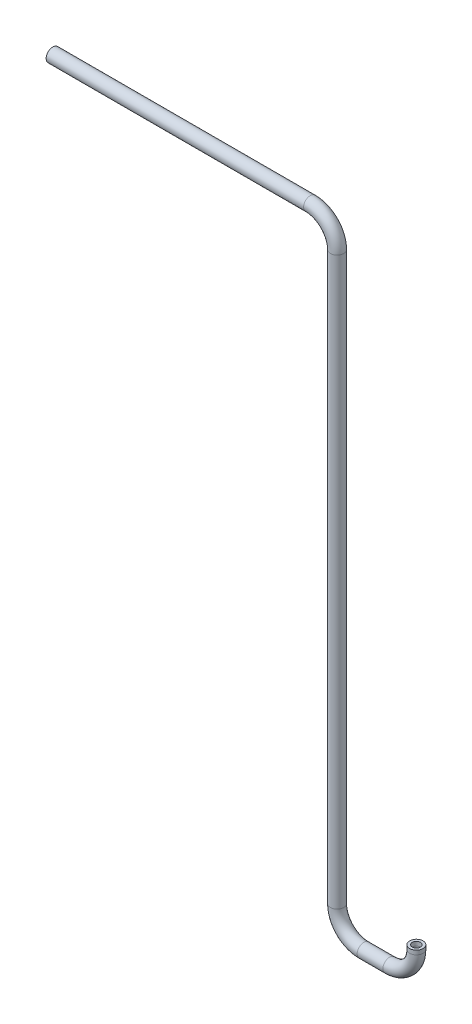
ISO-10303-21;
HEADER;
FILE_DESCRIPTION(('STEP AP214'),'2;1');
FILE_NAME('part.step','',(''),(''),'','','');
FILE_SCHEMA(('AUTOMOTIVE_DESIGN { 1 0 10303 214 1 1 1 1 }'));
ENDSEC;
DATA;
#1=APPLICATION_CONTEXT('core data for automotive mechanical design processes');
#2=APPLICATION_PROTOCOL_DEFINITION('international standard','automotive_design',2000,#1);
#3=PRODUCT_CONTEXT('',#1,'mechanical');
#4=PRODUCT('Part','Part','',(#3));
#5=PRODUCT_RELATED_PRODUCT_CATEGORY('part','',(#4));
#6=PRODUCT_DEFINITION_FORMATION('','',#4);
#7=PRODUCT_DEFINITION_CONTEXT('part definition',#1,'design');
#8=PRODUCT_DEFINITION('design','',#6,#7);
#9=PRODUCT_DEFINITION_SHAPE('','',#8);
#10=(LENGTH_UNIT() NAMED_UNIT(*) SI_UNIT(.MILLI.,.METRE.));
#11=(NAMED_UNIT(*) PLANE_ANGLE_UNIT() SI_UNIT($,.RADIAN.));
#12=(NAMED_UNIT(*) SI_UNIT($,.STERADIAN.) SOLID_ANGLE_UNIT());
#13=UNCERTAINTY_MEASURE_WITH_UNIT(LENGTH_MEASURE(1.E-05),#10,'distance_accuracy_value','');
#14=(GEOMETRIC_REPRESENTATION_CONTEXT(3) GLOBAL_UNCERTAINTY_ASSIGNED_CONTEXT((#13)) GLOBAL_UNIT_ASSIGNED_CONTEXT((#10,
#11,#12)) REPRESENTATION_CONTEXT('',''));
#15=CARTESIAN_POINT('',(0.,0.,0.));
#16=DIRECTION('',(0.,0.,1.));
#17=DIRECTION('',(1.,0.,0.));
#18=AXIS2_PLACEMENT_3D('',#15,#16,#17);
#19=CARTESIAN_POINT('',(-51.0000000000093,651.999999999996,0.));
#20=DIRECTION('',(-1.,0.,0.));
#21=DIRECTION('',(0.,0.,1.));
#22=AXIS2_PLACEMENT_3D('',#19,#20,#21);
#23=CYLINDRICAL_SURFACE('',#22,4.);
#24=CARTESIAN_POINT('',(-301.000000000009,651.999999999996,0.));
#25=DIRECTION('',(1.,0.,0.));
#26=DIRECTION('',(0.,0.,-1.));
#27=AXIS2_PLACEMENT_3D('',#24,#25,#26);
#28=CIRCLE('',#27,4.);
#29=CARTESIAN_POINT('',(-301.000000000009,651.999999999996,-4.));
#30=VERTEX_POINT('',#29);
#31=EDGE_CURVE('E66',#30,#30,#28,.T.);
#32=ORIENTED_EDGE('',*,*,#31,.F.);
#33=EDGE_LOOP('',(#32));
#34=FACE_BOUND('',#33,.T.);
#35=CARTESIAN_POINT('',(-51.,651.999999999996,0.));
#36=DIRECTION('',(1.,0.,0.));
#37=DIRECTION('',(0.,0.,-1.));
#38=AXIS2_PLACEMENT_3D('',#35,#36,#37);
#39=CIRCLE('',#38,4.);
#40=CARTESIAN_POINT('',(-51.,651.999999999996,-4.));
#41=VERTEX_POINT('',#40);
#42=EDGE_CURVE('E61',#41,#41,#39,.T.);
#43=ORIENTED_EDGE('',*,*,#42,.T.);
#44=EDGE_LOOP('',(#43));
#45=FACE_BOUND('',#44,.T.);
#46=ADVANCED_FACE('F57',(#34,#45),#23,.F.);
#47=CARTESIAN_POINT('',(-51.0000000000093,651.999999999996,0.));
#48=DIRECTION('',(-1.,0.,0.));
#49=DIRECTION('',(0.,0.,1.));
#50=AXIS2_PLACEMENT_3D('',#47,#48,#49);
#51=CYLINDRICAL_SURFACE('',#50,6.5);
#52=CARTESIAN_POINT('',(-301.000000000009,651.999999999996,0.));
#53=DIRECTION('',(1.,0.,0.));
#54=DIRECTION('',(0.,0.,-1.));
#55=AXIS2_PLACEMENT_3D('',#52,#53,#54);
#56=CIRCLE('',#55,6.5);
#57=CARTESIAN_POINT('',(-301.000000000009,651.999999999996,-6.5));
#58=VERTEX_POINT('',#57);
#59=EDGE_CURVE('E72',#58,#58,#56,.T.);
#60=ORIENTED_EDGE('',*,*,#59,.T.);
#61=EDGE_LOOP('',(#60));
#62=FACE_BOUND('',#61,.T.);
#63=CARTESIAN_POINT('',(-51.,651.999999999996,0.));
#64=DIRECTION('',(1.,0.,0.));
#65=DIRECTION('',(0.,0.,-1.));
#66=AXIS2_PLACEMENT_3D('',#63,#64,#65);
#67=CIRCLE('',#66,6.5);
#68=CARTESIAN_POINT('',(-51.,651.999999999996,-6.5));
#69=VERTEX_POINT('',#68);
#70=EDGE_CURVE('E12',#69,#69,#67,.T.);
#71=ORIENTED_EDGE('',*,*,#70,.F.);
#72=EDGE_LOOP('',(#71));
#73=FACE_BOUND('',#72,.T.);
#74=ADVANCED_FACE('F88',(#62,#73),#51,.T.);
#75=CARTESIAN_POINT('',(-301.000000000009,651.999999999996,0.));
#76=DIRECTION('',(1.,0.,0.));
#77=DIRECTION('',(0.,0.,-1.));
#78=AXIS2_PLACEMENT_3D('',#75,#76,#77);
#79=PLANE('',#78);
#80=ORIENTED_EDGE('',*,*,#31,.T.);
#81=EDGE_LOOP('',(#80));
#82=FACE_BOUND('',#81,.T.);
#83=ORIENTED_EDGE('',*,*,#59,.F.);
#84=EDGE_LOOP('',(#83));
#85=FACE_BOUND('',#84,.T.);
#86=ADVANCED_FACE('F84',(#82,#85),#79,.F.);
#87=CARTESIAN_POINT('',(-51.,652.,0.));
#88=DIRECTION('',(1.,0.,0.));
#89=DIRECTION('',(0.,0.,-1.));
#90=AXIS2_PLACEMENT_3D('',#87,#88,#89);
#91=PLANE('',#90);
#92=ORIENTED_EDGE('',*,*,#42,.F.);
#93=EDGE_LOOP('',(#92));
#94=FACE_BOUND('',#93,.T.);
#95=ORIENTED_EDGE('',*,*,#70,.T.);
#96=EDGE_LOOP('',(#95));
#97=FACE_BOUND('',#96,.T.);
#98=ADVANCED_FACE('F59',(#94,#97),#91,.T.);
#99=CLOSED_SHELL('',(#46,#74,#86,#98));
#100=MANIFOLD_SOLID_BREP('B2',#99);
#101=CARTESIAN_POINT('',(-51.,626.,0.));
#102=DIRECTION('',(0.,0.,1.));
#103=DIRECTION('',(1.,0.,0.));
#104=AXIS2_PLACEMENT_3D('',#101,#102,#103);
#105=TOROIDAL_SURFACE('',#104,25.9999999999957,4.);
#106=CARTESIAN_POINT('',(-25.0000000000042,626.,0.));
#107=DIRECTION('',(0.,-1.,0.));
#108=DIRECTION('',(0.,0.,-1.));
#109=AXIS2_PLACEMENT_3D('',#106,#107,#108);
#110=CIRCLE('',#109,4.);
#111=CARTESIAN_POINT('',(-21.0000000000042,626.,0.));
#112=VERTEX_POINT('',#111);
#113=EDGE_CURVE('E172',#112,#112,#110,.F.);
#114=CARTESIAN_POINT('',(-51.,651.999999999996,0.));
#115=DIRECTION('',(-1.,0.,0.));
#116=DIRECTION('',(0.,0.,1.));
#117=AXIS2_PLACEMENT_3D('',#114,#115,#116);
#118=CIRCLE('',#117,4.);
#119=CARTESIAN_POINT('',(-51.,655.999999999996,0.));
#120=VERTEX_POINT('',#119);
#121=EDGE_CURVE('E56',#120,#120,#118,.F.);
#122=CARTESIAN_POINT('',(-51.,626.,0.));
#123=DIRECTION('',(0.,0.,1.));
#124=DIRECTION('',(1.,0.,0.));
#125=AXIS2_PLACEMENT_3D('',#122,#123,#124);
#126=CIRCLE('',#125,29.9999999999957);
#127=EDGE_CURVE('',#112,#120,#126,.T.);
#128=ORIENTED_EDGE('',*,*,#113,.F.);
#129=ORIENTED_EDGE('',*,*,#121,.F.);
#130=ORIENTED_EDGE('',*,*,#127,.T.);
#131=ORIENTED_EDGE('',*,*,#127,.F.);
#132=EDGE_LOOP('',(#128,#130,#129,#131));
#133=FACE_BOUND('',#132,.T.);
#134=ADVANCED_FACE('F159',(#133),#105,.F.);
#135=CARTESIAN_POINT('',(-51.,626.,0.));
#136=DIRECTION('',(0.,0.,1.));
#137=DIRECTION('',(1.,0.,0.));
#138=AXIS2_PLACEMENT_3D('',#135,#136,#137);
#139=TOROIDAL_SURFACE('',#138,25.9999999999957,6.5);
#140=CARTESIAN_POINT('',(-25.0000000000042,626.,0.));
#141=DIRECTION('',(0.,-1.,0.));
#142=DIRECTION('',(0.,0.,-1.));
#143=AXIS2_PLACEMENT_3D('',#140,#141,#142);
#144=CIRCLE('',#143,6.5);
#145=CARTESIAN_POINT('',(-18.5000000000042,626.,0.));
#146=VERTEX_POINT('',#145);
#147=EDGE_CURVE('E178',#146,#146,#144,.T.);
#148=CARTESIAN_POINT('',(-51.,651.999999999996,0.));
#149=DIRECTION('',(-1.,0.,0.));
#150=DIRECTION('',(0.,0.,1.));
#151=AXIS2_PLACEMENT_3D('',#148,#149,#150);
#152=CIRCLE('',#151,6.5);
#153=CARTESIAN_POINT('',(-51.,658.499999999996,0.));
#154=VERTEX_POINT('',#153);
#155=EDGE_CURVE('E167',#154,#154,#152,.T.);
#156=CARTESIAN_POINT('',(-51.,626.,0.));
#157=DIRECTION('',(0.,0.,1.));
#158=DIRECTION('',(1.,0.,0.));
#159=AXIS2_PLACEMENT_3D('',#156,#157,#158);
#160=CIRCLE('',#159,32.4999999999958);
#161=EDGE_CURVE('',#146,#154,#160,.T.);
#162=ORIENTED_EDGE('',*,*,#147,.F.);
#163=ORIENTED_EDGE('',*,*,#155,.F.);
#164=ORIENTED_EDGE('',*,*,#161,.T.);
#165=ORIENTED_EDGE('',*,*,#161,.F.);
#166=EDGE_LOOP('',(#162,#164,#163,#165));
#167=FACE_BOUND('',#166,.T.);
#168=ADVANCED_FACE('F187',(#167),#139,.T.);
#169=CARTESIAN_POINT('',(-25.,626.,0.));
#170=DIRECTION('',(0.,-1.,0.));
#171=DIRECTION('',(0.,0.,-1.));
#172=AXIS2_PLACEMENT_3D('',#169,#170,#171);
#173=PLANE('',#172);
#174=ORIENTED_EDGE('',*,*,#147,.T.);
#175=EDGE_LOOP('',(#174));
#176=FACE_BOUND('',#175,.T.);
#177=ORIENTED_EDGE('',*,*,#113,.T.);
#178=EDGE_LOOP('',(#177));
#179=FACE_BOUND('',#178,.T.);
#180=ADVANCED_FACE('F184',(#176,#179),#173,.T.);
#181=CARTESIAN_POINT('',(-51.,652.,0.));
#182=DIRECTION('',(-1.,0.,0.));
#183=DIRECTION('',(0.,0.,1.));
#184=AXIS2_PLACEMENT_3D('',#181,#182,#183);
#185=PLANE('',#184);
#186=ORIENTED_EDGE('',*,*,#155,.T.);
#187=EDGE_LOOP('',(#186));
#188=FACE_BOUND('',#187,.T.);
#189=ORIENTED_EDGE('',*,*,#121,.T.);
#190=EDGE_LOOP('',(#189));
#191=FACE_BOUND('',#190,.T.);
#192=ADVANCED_FACE('F161',(#188,#191),#185,.T.);
#193=CLOSED_SHELL('',(#134,#168,#180,#192));
#194=MANIFOLD_SOLID_BREP('B7',#193);
#195=CARTESIAN_POINT('',(-25.0000000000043,76.0000000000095,0.));
#196=DIRECTION('',(0.,1.,0.));
#197=DIRECTION('',(0.,0.,1.));
#198=AXIS2_PLACEMENT_3D('',#195,#196,#197);
#199=CYLINDRICAL_SURFACE('',#198,4.);
#200=CARTESIAN_POINT('',(-25.0000000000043,76.0000000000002,0.));
#201=DIRECTION('',(0.,-1.,0.));
#202=DIRECTION('',(1.,0.,0.));
#203=AXIS2_PLACEMENT_3D('',#200,#201,#202);
#204=CIRCLE('',#203,4.);
#205=CARTESIAN_POINT('',(-21.0000000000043,76.0000000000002,0.));
#206=VERTEX_POINT('',#205);
#207=EDGE_CURVE('E279',#206,#206,#204,.T.);
#208=ORIENTED_EDGE('',*,*,#207,.T.);
#209=EDGE_LOOP('',(#208));
#210=FACE_BOUND('',#209,.T.);
#211=CARTESIAN_POINT('',(-25.0000000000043,626.,0.));
#212=DIRECTION('',(0.,1.,0.));
#213=DIRECTION('',(-1.,0.,0.));
#214=AXIS2_PLACEMENT_3D('',#211,#212,#213);
#215=CIRCLE('',#214,4.);
#216=CARTESIAN_POINT('',(-29.0000000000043,626.,0.));
#217=VERTEX_POINT('',#216);
#218=EDGE_CURVE('E267',#217,#217,#215,.T.);
#219=ORIENTED_EDGE('',*,*,#218,.T.);
#220=EDGE_LOOP('',(#219));
#221=FACE_BOUND('',#220,.T.);
#222=ADVANCED_FACE('F263',(#210,#221),#199,.F.);
#223=CARTESIAN_POINT('',(-25.0000000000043,76.0000000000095,0.));
#224=DIRECTION('',(0.,1.,0.));
#225=DIRECTION('',(0.,0.,1.));
#226=AXIS2_PLACEMENT_3D('',#223,#224,#225);
#227=CYLINDRICAL_SURFACE('',#226,6.5);
#228=CARTESIAN_POINT('',(-25.0000000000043,76.0000000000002,0.));
#229=DIRECTION('',(0.,-1.,0.));
#230=DIRECTION('',(1.,0.,0.));
#231=AXIS2_PLACEMENT_3D('',#228,#229,#230);
#232=CIRCLE('',#231,6.5);
#233=CARTESIAN_POINT('',(-18.5000000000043,76.0000000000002,0.));
#234=VERTEX_POINT('',#233);
#235=EDGE_CURVE('E272',#234,#234,#232,.T.);
#236=ORIENTED_EDGE('',*,*,#235,.F.);
#237=EDGE_LOOP('',(#236));
#238=FACE_BOUND('',#237,.T.);
#239=CARTESIAN_POINT('',(-25.0000000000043,626.,0.));
#240=DIRECTION('',(0.,1.,0.));
#241=DIRECTION('',(-1.,0.,0.));
#242=AXIS2_PLACEMENT_3D('',#239,#240,#241);
#243=CIRCLE('',#242,6.5);
#244=CARTESIAN_POINT('',(-31.5000000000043,626.,0.));
#245=VERTEX_POINT('',#244);
#246=EDGE_CURVE('E158',#245,#245,#243,.T.);
#247=ORIENTED_EDGE('',*,*,#246,.F.);
#248=EDGE_LOOP('',(#247));
#249=FACE_BOUND('',#248,.T.);
#250=ADVANCED_FACE('F292',(#238,#249),#227,.T.);
#251=CARTESIAN_POINT('',(-25.,76.0000000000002,0.));
#252=DIRECTION('',(0.,-1.,0.));
#253=DIRECTION('',(1.,0.,0.));
#254=AXIS2_PLACEMENT_3D('',#251,#252,#253);
#255=PLANE('',#254);
#256=ORIENTED_EDGE('',*,*,#207,.F.);
#257=EDGE_LOOP('',(#256));
#258=FACE_BOUND('',#257,.T.);
#259=ORIENTED_EDGE('',*,*,#235,.T.);
#260=EDGE_LOOP('',(#259));
#261=FACE_BOUND('',#260,.T.);
#262=ADVANCED_FACE('F288',(#258,#261),#255,.T.);
#263=CARTESIAN_POINT('',(-25.,626.,0.));
#264=DIRECTION('',(0.,1.,0.));
#265=DIRECTION('',(-1.,0.,0.));
#266=AXIS2_PLACEMENT_3D('',#263,#264,#265);
#267=PLANE('',#266);
#268=ORIENTED_EDGE('',*,*,#218,.F.);
#269=EDGE_LOOP('',(#268));
#270=FACE_BOUND('',#269,.T.);
#271=ORIENTED_EDGE('',*,*,#246,.T.);
#272=EDGE_LOOP('',(#271));
#273=FACE_BOUND('',#272,.T.);
#274=ADVANCED_FACE('F265',(#270,#273),#267,.T.);
#275=CLOSED_SHELL('',(#222,#250,#262,#274));
#276=MANIFOLD_SOLID_BREP('B51',#275);
#277=CARTESIAN_POINT('',(1.00000000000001,76.,0.));
#278=DIRECTION('',(0.,0.,-1.));
#279=DIRECTION('',(-1.,0.,0.));
#280=AXIS2_PLACEMENT_3D('',#277,#278,#279);
#281=TOROIDAL_SURFACE('',#280,26.0000000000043,4.);
#282=CARTESIAN_POINT('',(1.00000000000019,49.9999999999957,0.));
#283=DIRECTION('',(1.,0.,0.));
#284=DIRECTION('',(0.,1.,0.));
#285=AXIS2_PLACEMENT_3D('',#282,#283,#284);
#286=CIRCLE('',#285,4.);
#287=CARTESIAN_POINT('',(1.00000000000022,45.9999999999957,0.));
#288=VERTEX_POINT('',#287);
#289=EDGE_CURVE('E376',#288,#288,#286,.F.);
#290=CARTESIAN_POINT('',(-25.0000000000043,76.,0.));
#291=DIRECTION('',(0.,1.,0.));
#292=DIRECTION('',(-1.,0.,0.));
#293=AXIS2_PLACEMENT_3D('',#290,#291,#292);
#294=CIRCLE('',#293,4.);
#295=CARTESIAN_POINT('',(-29.0000000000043,76.,0.));
#296=VERTEX_POINT('',#295);
#297=EDGE_CURVE('E262',#296,#296,#294,.F.);
#298=CARTESIAN_POINT('',(1.00000000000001,76.,0.));
#299=DIRECTION('',(0.,0.,-1.));
#300=DIRECTION('',(-1.,0.,0.));
#301=AXIS2_PLACEMENT_3D('',#298,#299,#300);
#302=CIRCLE('',#301,30.0000000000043);
#303=EDGE_CURVE('',#288,#296,#302,.T.);
#304=ORIENTED_EDGE('',*,*,#289,.F.);
#305=ORIENTED_EDGE('',*,*,#297,.F.);
#306=ORIENTED_EDGE('',*,*,#303,.T.);
#307=ORIENTED_EDGE('',*,*,#303,.F.);
#308=EDGE_LOOP('',(#304,#306,#305,#307));
#309=FACE_BOUND('',#308,.T.);
#310=ADVANCED_FACE('F365',(#309),#281,.F.);
#311=CARTESIAN_POINT('',(1.00000000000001,76.,0.));
#312=DIRECTION('',(0.,0.,-1.));
#313=DIRECTION('',(-1.,0.,0.));
#314=AXIS2_PLACEMENT_3D('',#311,#312,#313);
#315=TOROIDAL_SURFACE('',#314,26.0000000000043,6.5);
#316=CARTESIAN_POINT('',(1.00000000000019,49.9999999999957,0.));
#317=DIRECTION('',(1.,0.,0.));
#318=DIRECTION('',(0.,1.,0.));
#319=AXIS2_PLACEMENT_3D('',#316,#317,#318);
#320=CIRCLE('',#319,6.5);
#321=CARTESIAN_POINT('',(1.00000000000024,43.4999999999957,0.));
#322=VERTEX_POINT('',#321);
#323=EDGE_CURVE('E381',#322,#322,#320,.T.);
#324=CARTESIAN_POINT('',(-25.0000000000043,76.,0.));
#325=DIRECTION('',(0.,1.,0.));
#326=DIRECTION('',(-1.,0.,0.));
#327=AXIS2_PLACEMENT_3D('',#324,#325,#326);
#328=CIRCLE('',#327,6.5);
#329=CARTESIAN_POINT('',(-31.5000000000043,76.,0.));
#330=VERTEX_POINT('',#329);
#331=EDGE_CURVE('E372',#330,#330,#328,.T.);
#332=CARTESIAN_POINT('',(1.00000000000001,76.,0.));
#333=DIRECTION('',(0.,0.,-1.));
#334=DIRECTION('',(-1.,0.,0.));
#335=AXIS2_PLACEMENT_3D('',#332,#333,#334);
#336=CIRCLE('',#335,32.5000000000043);
#337=EDGE_CURVE('',#322,#330,#336,.T.);
#338=ORIENTED_EDGE('',*,*,#323,.F.);
#339=ORIENTED_EDGE('',*,*,#331,.F.);
#340=ORIENTED_EDGE('',*,*,#337,.T.);
#341=ORIENTED_EDGE('',*,*,#337,.F.);
#342=EDGE_LOOP('',(#338,#340,#339,#341));
#343=FACE_BOUND('',#342,.T.);
#344=ADVANCED_FACE('F389',(#343),#315,.T.);
#345=CARTESIAN_POINT('',(1.00000000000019,50.,0.));
#346=DIRECTION('',(1.,0.,0.));
#347=DIRECTION('',(0.,1.,0.));
#348=AXIS2_PLACEMENT_3D('',#345,#346,#347);
#349=PLANE('',#348);
#350=ORIENTED_EDGE('',*,*,#323,.T.);
#351=EDGE_LOOP('',(#350));
#352=FACE_BOUND('',#351,.T.);
#353=ORIENTED_EDGE('',*,*,#289,.T.);
#354=EDGE_LOOP('',(#353));
#355=FACE_BOUND('',#354,.T.);
#356=ADVANCED_FACE('F386',(#352,#355),#349,.T.);
#357=CARTESIAN_POINT('',(-25.,76.0000000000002,0.));
#358=DIRECTION('',(0.,1.,0.));
#359=DIRECTION('',(-1.,0.,0.));
#360=AXIS2_PLACEMENT_3D('',#357,#358,#359);
#361=PLANE('',#360);
#362=ORIENTED_EDGE('',*,*,#331,.T.);
#363=EDGE_LOOP('',(#362));
#364=FACE_BOUND('',#363,.T.);
#365=ORIENTED_EDGE('',*,*,#297,.T.);
#366=EDGE_LOOP('',(#365));
#367=FACE_BOUND('',#366,.T.);
#368=ADVANCED_FACE('F367',(#364,#367),#361,.T.);
#369=CLOSED_SHELL('',(#310,#344,#356,#368));
#370=MANIFOLD_SOLID_BREP('B153',#369);
#371=CARTESIAN_POINT('',(26.,50.,0.));
#372=DIRECTION('',(-1.,0.,0.));
#373=DIRECTION('',(0.,0.,1.));
#374=AXIS2_PLACEMENT_3D('',#371,#372,#373);
#375=CYLINDRICAL_SURFACE('',#374,4.);
#376=CARTESIAN_POINT('',(26.,50.,0.));
#377=DIRECTION('',(1.,0.,0.));
#378=DIRECTION('',(0.,0.,-1.));
#379=AXIS2_PLACEMENT_3D('',#376,#377,#378);
#380=CIRCLE('',#379,4.);
#381=CARTESIAN_POINT('',(26.,50.,-4.));
#382=VERTEX_POINT('',#381);
#383=EDGE_CURVE('E479',#382,#382,#380,.T.);
#384=ORIENTED_EDGE('',*,*,#383,.T.);
#385=EDGE_LOOP('',(#384));
#386=FACE_BOUND('',#385,.T.);
#387=CARTESIAN_POINT('',(1.00000000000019,50.,0.));
#388=DIRECTION('',(-1.,0.,0.));
#389=DIRECTION('',(0.,0.,1.));
#390=AXIS2_PLACEMENT_3D('',#387,#388,#389);
#391=CIRCLE('',#390,4.);
#392=CARTESIAN_POINT('',(1.00000000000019,50.,4.));
#393=VERTEX_POINT('',#392);
#394=EDGE_CURVE('E469',#393,#393,#391,.T.);
#395=ORIENTED_EDGE('',*,*,#394,.T.);
#396=EDGE_LOOP('',(#395));
#397=FACE_BOUND('',#396,.T.);
#398=ADVANCED_FACE('F465',(#386,#397),#375,.F.);
#399=CARTESIAN_POINT('',(26.,50.,0.));
#400=DIRECTION('',(-1.,0.,0.));
#401=DIRECTION('',(0.,0.,1.));
#402=AXIS2_PLACEMENT_3D('',#399,#400,#401);
#403=CYLINDRICAL_SURFACE('',#402,6.5);
#404=CARTESIAN_POINT('',(26.,50.,0.));
#405=DIRECTION('',(1.,0.,0.));
#406=DIRECTION('',(0.,0.,-1.));
#407=AXIS2_PLACEMENT_3D('',#404,#405,#406);
#408=CIRCLE('',#407,6.5);
#409=CARTESIAN_POINT('',(26.,50.,-6.5));
#410=VERTEX_POINT('',#409);
#411=EDGE_CURVE('E473',#410,#410,#408,.T.);
#412=ORIENTED_EDGE('',*,*,#411,.F.);
#413=EDGE_LOOP('',(#412));
#414=FACE_BOUND('',#413,.T.);
#415=CARTESIAN_POINT('',(1.00000000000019,50.,0.));
#416=DIRECTION('',(-1.,0.,0.));
#417=DIRECTION('',(0.,0.,1.));
#418=AXIS2_PLACEMENT_3D('',#415,#416,#417);
#419=CIRCLE('',#418,6.5);
#420=CARTESIAN_POINT('',(1.00000000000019,50.,6.5));
#421=VERTEX_POINT('',#420);
#422=EDGE_CURVE('E364',#421,#421,#419,.T.);
#423=ORIENTED_EDGE('',*,*,#422,.F.);
#424=EDGE_LOOP('',(#423));
#425=FACE_BOUND('',#424,.T.);
#426=ADVANCED_FACE('F492',(#414,#425),#403,.T.);
#427=CARTESIAN_POINT('',(26.,50.,0.));
#428=DIRECTION('',(1.,0.,0.));
#429=DIRECTION('',(0.,0.,-1.));
#430=AXIS2_PLACEMENT_3D('',#427,#428,#429);
#431=PLANE('',#430);
#432=ORIENTED_EDGE('',*,*,#383,.F.);
#433=EDGE_LOOP('',(#432));
#434=FACE_BOUND('',#433,.T.);
#435=ORIENTED_EDGE('',*,*,#411,.T.);
#436=EDGE_LOOP('',(#435));
#437=FACE_BOUND('',#436,.T.);
#438=ADVANCED_FACE('F488',(#434,#437),#431,.T.);
#439=CARTESIAN_POINT('',(1.00000000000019,50.,0.));
#440=DIRECTION('',(-1.,0.,0.));
#441=DIRECTION('',(0.,0.,1.));
#442=AXIS2_PLACEMENT_3D('',#439,#440,#441);
#443=PLANE('',#442);
#444=ORIENTED_EDGE('',*,*,#394,.F.);
#445=EDGE_LOOP('',(#444));
#446=FACE_BOUND('',#445,.T.);
#447=ORIENTED_EDGE('',*,*,#422,.T.);
#448=EDGE_LOOP('',(#447));
#449=FACE_BOUND('',#448,.T.);
#450=ADVANCED_FACE('F467',(#446,#449),#443,.T.);
#451=CLOSED_SHELL('',(#398,#426,#438,#450));
#452=MANIFOLD_SOLID_BREP('B257',#451);
#453=CARTESIAN_POINT('',(26.,76.,0.));
#454=DIRECTION('',(0.,0.,1.));
#455=DIRECTION('',(1.,0.,0.));
#456=AXIS2_PLACEMENT_3D('',#453,#454,#455);
#457=TOROIDAL_SURFACE('',#456,26.,4.);
#458=CARTESIAN_POINT('',(26.,50.,0.));
#459=DIRECTION('',(-1.,0.,0.));
#460=DIRECTION('',(0.,0.,1.));
#461=AXIS2_PLACEMENT_3D('',#458,#459,#460);
#462=CIRCLE('',#461,4.);
#463=CARTESIAN_POINT('',(26.,46.,0.));
#464=VERTEX_POINT('',#463);
#465=EDGE_CURVE('E574',#464,#464,#462,.T.);
#466=CARTESIAN_POINT('',(52.,76.,0.));
#467=DIRECTION('',(0.,1.,0.));
#468=DIRECTION('',(-1.,0.,0.));
#469=AXIS2_PLACEMENT_3D('',#466,#467,#468);
#470=CIRCLE('',#469,4.);
#471=CARTESIAN_POINT('',(56.,76.,0.));
#472=VERTEX_POINT('',#471);
#473=EDGE_CURVE('E464',#472,#472,#470,.T.);
#474=CARTESIAN_POINT('',(26.,76.,0.));
#475=DIRECTION('',(0.,0.,1.));
#476=DIRECTION('',(1.,0.,0.));
#477=AXIS2_PLACEMENT_3D('',#474,#475,#476);
#478=CIRCLE('',#477,30.);
#479=EDGE_CURVE('',#464,#472,#478,.T.);
#480=ORIENTED_EDGE('',*,*,#465,.T.);
#481=ORIENTED_EDGE('',*,*,#473,.T.);
#482=ORIENTED_EDGE('',*,*,#479,.T.);
#483=ORIENTED_EDGE('',*,*,#479,.F.);
#484=EDGE_LOOP('',(#480,#482,#481,#483));
#485=FACE_BOUND('',#484,.T.);
#486=ADVANCED_FACE('F564',(#485),#457,.F.);
#487=CARTESIAN_POINT('',(52.,76.,0.));
#488=DIRECTION('',(0.,1.,0.));
#489=DIRECTION('',(-1.,0.,0.));
#490=AXIS2_PLACEMENT_3D('',#487,#488,#489);
#491=PLANE('',#490);
#492=ORIENTED_EDGE('',*,*,#473,.F.);
#493=EDGE_LOOP('',(#492));
#494=FACE_BOUND('',#493,.T.);
#495=CARTESIAN_POINT('',(52.,76.,0.));
#496=DIRECTION('',(0.,1.,0.));
#497=DIRECTION('',(-1.,0.,0.));
#498=AXIS2_PLACEMENT_3D('',#495,#496,#497);
#499=CIRCLE('',#498,6.5);
#500=CARTESIAN_POINT('',(58.5,76.,0.));
#501=VERTEX_POINT('',#500);
#502=EDGE_CURVE('E570',#501,#501,#499,.F.);
#503=ORIENTED_EDGE('',*,*,#502,.F.);
#504=EDGE_LOOP('',(#503));
#505=FACE_BOUND('',#504,.T.);
#506=ADVANCED_FACE('F593',(#494,#505),#491,.T.);
#507=CARTESIAN_POINT('',(26.,76.,0.));
#508=DIRECTION('',(0.,0.,1.));
#509=DIRECTION('',(1.,0.,0.));
#510=AXIS2_PLACEMENT_3D('',#507,#508,#509);
#511=TOROIDAL_SURFACE('',#510,26.,6.5);
#512=CARTESIAN_POINT('',(26.,50.,0.));
#513=DIRECTION('',(-1.,0.,0.));
#514=DIRECTION('',(0.,0.,1.));
#515=AXIS2_PLACEMENT_3D('',#512,#513,#514);
#516=CIRCLE('',#515,6.5);
#517=CARTESIAN_POINT('',(26.,43.5,0.));
#518=VERTEX_POINT('',#517);
#519=EDGE_CURVE('E578',#518,#518,#516,.F.);
#520=CARTESIAN_POINT('',(26.,76.,0.));
#521=DIRECTION('',(0.,0.,1.));
#522=DIRECTION('',(1.,0.,0.));
#523=AXIS2_PLACEMENT_3D('',#520,#521,#522);
#524=CIRCLE('',#523,32.5);
#525=EDGE_CURVE('',#518,#501,#524,.T.);
#526=ORIENTED_EDGE('',*,*,#519,.T.);
#527=ORIENTED_EDGE('',*,*,#502,.T.);
#528=ORIENTED_EDGE('',*,*,#525,.T.);
#529=ORIENTED_EDGE('',*,*,#525,.F.);
#530=EDGE_LOOP('',(#526,#528,#527,#529));
#531=FACE_BOUND('',#530,.T.);
#532=ADVANCED_FACE('F584',(#531),#511,.T.);
#533=CARTESIAN_POINT('',(26.,50.,0.));
#534=DIRECTION('',(-1.,0.,0.));
#535=DIRECTION('',(0.,0.,1.));
#536=AXIS2_PLACEMENT_3D('',#533,#534,#535);
#537=PLANE('',#536);
#538=ORIENTED_EDGE('',*,*,#465,.F.);
#539=EDGE_LOOP('',(#538));
#540=FACE_BOUND('',#539,.T.);
#541=ORIENTED_EDGE('',*,*,#519,.F.);
#542=EDGE_LOOP('',(#541));
#543=FACE_BOUND('',#542,.T.);
#544=ADVANCED_FACE('F586',(#540,#543),#537,.T.);
#545=CLOSED_SHELL('',(#486,#506,#532,#544));
#546=MANIFOLD_SOLID_BREP('B359',#545);
#547=CARTESIAN_POINT('',(52.,80.,0.));
#548=DIRECTION('',(0.,-1.,0.));
#549=DIRECTION('',(0.,0.,-1.));
#550=AXIS2_PLACEMENT_3D('',#547,#548,#549);
#551=CYLINDRICAL_SURFACE('',#550,4.);
#552=CARTESIAN_POINT('',(52.,80.,0.));
#553=DIRECTION('',(0.,1.,0.));
#554=DIRECTION('',(0.,0.,-1.));
#555=AXIS2_PLACEMENT_3D('',#552,#553,#554);
#556=CIRCLE('',#555,4.);
#557=CARTESIAN_POINT('',(52.,80.,-4.));
#558=VERTEX_POINT('',#557);
#559=EDGE_CURVE('E670',#558,#558,#556,.T.);
#560=ORIENTED_EDGE('',*,*,#559,.T.);
#561=EDGE_LOOP('',(#560));
#562=FACE_BOUND('',#561,.T.);
#563=CARTESIAN_POINT('',(52.,76.,0.));
#564=DIRECTION('',(0.,-1.,0.));
#565=DIRECTION('',(1.,0.,0.));
#566=AXIS2_PLACEMENT_3D('',#563,#564,#565);
#567=CIRCLE('',#566,4.);
#568=CARTESIAN_POINT('',(56.,76.,0.));
#569=VERTEX_POINT('',#568);
#570=EDGE_CURVE('E660',#569,#569,#567,.T.);
#571=ORIENTED_EDGE('',*,*,#570,.T.);
#572=EDGE_LOOP('',(#571));
#573=FACE_BOUND('',#572,.T.);
#574=ADVANCED_FACE('F656',(#562,#573),#551,.F.);
#575=CARTESIAN_POINT('',(52.,80.,0.));
#576=DIRECTION('',(0.,-1.,0.));
#577=DIRECTION('',(0.,0.,-1.));
#578=AXIS2_PLACEMENT_3D('',#575,#576,#577);
#579=CYLINDRICAL_SURFACE('',#578,6.5);
#580=CARTESIAN_POINT('',(52.,80.,0.));
#581=DIRECTION('',(0.,1.,0.));
#582=DIRECTION('',(0.,0.,-1.));
#583=AXIS2_PLACEMENT_3D('',#580,#581,#582);
#584=CIRCLE('',#583,6.5);
#585=CARTESIAN_POINT('',(52.,80.,-6.5));
#586=VERTEX_POINT('',#585);
#587=EDGE_CURVE('E664',#586,#586,#584,.T.);
#588=ORIENTED_EDGE('',*,*,#587,.F.);
#589=EDGE_LOOP('',(#588));
#590=FACE_BOUND('',#589,.T.);
#591=CARTESIAN_POINT('',(52.,76.,0.));
#592=DIRECTION('',(0.,-1.,0.));
#593=DIRECTION('',(1.,0.,0.));
#594=AXIS2_PLACEMENT_3D('',#591,#592,#593);
#595=CIRCLE('',#594,6.5);
#596=CARTESIAN_POINT('',(58.5,76.,0.));
#597=VERTEX_POINT('',#596);
#598=EDGE_CURVE('E563',#597,#597,#595,.T.);
#599=ORIENTED_EDGE('',*,*,#598,.F.);
#600=EDGE_LOOP('',(#599));
#601=FACE_BOUND('',#600,.T.);
#602=ADVANCED_FACE('F683',(#590,#601),#579,.T.);
#603=CARTESIAN_POINT('',(52.,80.,0.));
#604=DIRECTION('',(0.,1.,0.));
#605=DIRECTION('',(0.,0.,-1.));
#606=AXIS2_PLACEMENT_3D('',#603,#604,#605);
#607=PLANE('',#606);
#608=ORIENTED_EDGE('',*,*,#559,.F.);
#609=EDGE_LOOP('',(#608));
#610=FACE_BOUND('',#609,.T.);
#611=ORIENTED_EDGE('',*,*,#587,.T.);
#612=EDGE_LOOP('',(#611));
#613=FACE_BOUND('',#612,.T.);
#614=ADVANCED_FACE('F679',(#610,#613),#607,.T.);
#615=CARTESIAN_POINT('',(52.,76.,0.));
#616=DIRECTION('',(0.,-1.,0.));
#617=DIRECTION('',(1.,0.,0.));
#618=AXIS2_PLACEMENT_3D('',#615,#616,#617);
#619=PLANE('',#618);
#620=ORIENTED_EDGE('',*,*,#570,.F.);
#621=EDGE_LOOP('',(#620));
#622=FACE_BOUND('',#621,.T.);
#623=ORIENTED_EDGE('',*,*,#598,.T.);
#624=EDGE_LOOP('',(#623));
#625=FACE_BOUND('',#624,.T.);
#626=ADVANCED_FACE('F658',(#622,#625),#619,.T.);
#627=CLOSED_SHELL('',(#574,#602,#614,#626));
#628=MANIFOLD_SOLID_BREP('B459',#627);
#629=ADVANCED_BREP_SHAPE_REPRESENTATION('',(#18,#100,#194,#276,#370,#452,#546,#628),#14);
#630=SHAPE_DEFINITION_REPRESENTATION(#9,#629);
ENDSEC;
END-ISO-10303-21;
